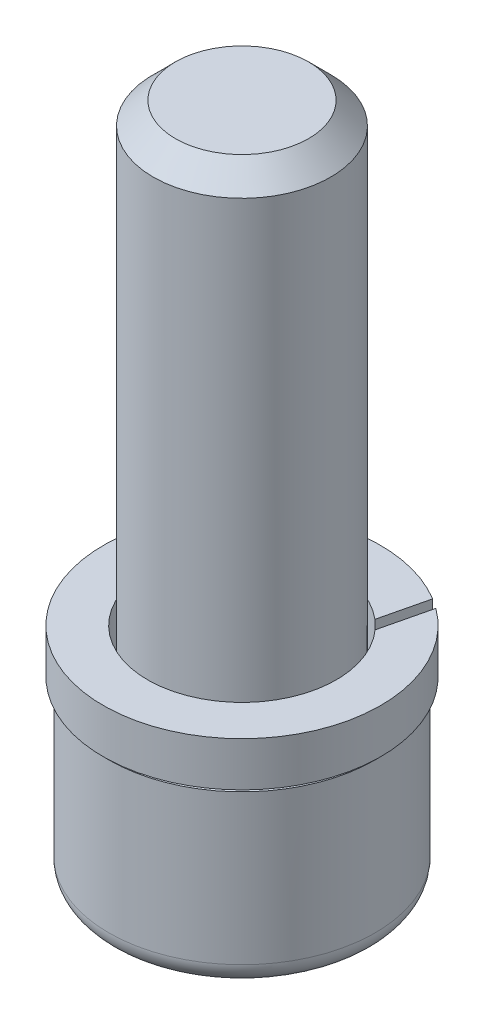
ISO-10303-21;
HEADER;
FILE_DESCRIPTION(('STEP AP214'),'2;1');
FILE_NAME('part.step','',(''),(''),'','','');
FILE_SCHEMA(('AUTOMOTIVE_DESIGN { 1 0 10303 214 1 1 1 1 }'));
ENDSEC;
DATA;
#1=APPLICATION_CONTEXT('core data for automotive mechanical design processes');
#2=APPLICATION_PROTOCOL_DEFINITION('international standard','automotive_design',2000,#1);
#3=PRODUCT_CONTEXT('',#1,'mechanical');
#4=PRODUCT('Part','Part','',(#3));
#5=PRODUCT_RELATED_PRODUCT_CATEGORY('part','',(#4));
#6=PRODUCT_DEFINITION_FORMATION('','',#4);
#7=PRODUCT_DEFINITION_CONTEXT('part definition',#1,'design');
#8=PRODUCT_DEFINITION('design','',#6,#7);
#9=PRODUCT_DEFINITION_SHAPE('','',#8);
#10=(LENGTH_UNIT() NAMED_UNIT(*) SI_UNIT(.MILLI.,.METRE.));
#11=(NAMED_UNIT(*) PLANE_ANGLE_UNIT() SI_UNIT($,.RADIAN.));
#12=(NAMED_UNIT(*) SI_UNIT($,.STERADIAN.) SOLID_ANGLE_UNIT());
#13=UNCERTAINTY_MEASURE_WITH_UNIT(LENGTH_MEASURE(1.E-05),#10,'distance_accuracy_value','');
#14=(GEOMETRIC_REPRESENTATION_CONTEXT(3) GLOBAL_UNCERTAINTY_ASSIGNED_CONTEXT((#13)) GLOBAL_UNIT_ASSIGNED_CONTEXT((#10,
#11,#12)) REPRESENTATION_CONTEXT('',''));
#15=CARTESIAN_POINT('',(0.,0.,0.));
#16=DIRECTION('',(0.,0.,1.));
#17=DIRECTION('',(1.,0.,0.));
#18=AXIS2_PLACEMENT_3D('',#15,#16,#17);
#19=CARTESIAN_POINT('',(0.,10.,0.));
#20=DIRECTION('',(0.,-1.,0.));
#21=DIRECTION('',(0.,0.,-1.));
#22=AXIS2_PLACEMENT_3D('',#19,#20,#21);
#23=PLANE('',#22);
#24=DIRECTION('',(-0.866025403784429,0.,-0.500000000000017));
#25=VECTOR('',#24,1.);
#26=CARTESIAN_POINT('',(0.,10.,-6.928203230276));
#27=LINE('',#26,#25);
#28=CARTESIAN_POINT('',(0.,10.,-6.92820323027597));
#29=VERTEX_POINT('',#28);
#30=CARTESIAN_POINT('',(6.00000000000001,10.,-3.46410161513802));
#31=VERTEX_POINT('',#30);
#32=EDGE_CURVE('E107',#29,#31,#27,.F.);
#33=ORIENTED_EDGE('',*,*,#32,.T.);
#34=DIRECTION('',(0.,0.,-1.));
#35=VECTOR('',#34,1.);
#36=CARTESIAN_POINT('',(6.,10.,-3.464101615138));
#37=LINE('',#36,#35);
#38=CARTESIAN_POINT('',(6.,10.,3.464101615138));
#39=VERTEX_POINT('',#38);
#40=EDGE_CURVE('E101',#31,#39,#37,.F.);
#41=ORIENTED_EDGE('',*,*,#40,.T.);
#42=DIRECTION('',(0.866025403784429,0.,-0.500000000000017));
#43=VECTOR('',#42,1.);
#44=CARTESIAN_POINT('',(6.,10.,3.464101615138));
#45=LINE('',#44,#43);
#46=CARTESIAN_POINT('',(1.95996647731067E-13,10.,6.92820323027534));
#47=VERTEX_POINT('',#46);
#48=EDGE_CURVE('E104',#39,#47,#45,.F.);
#49=ORIENTED_EDGE('',*,*,#48,.T.);
#50=DIRECTION('',(0.866025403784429,0.,0.500000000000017));
#51=VECTOR('',#50,1.);
#52=CARTESIAN_POINT('',(0.,10.,6.928203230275));
#53=LINE('',#52,#51);
#54=CARTESIAN_POINT('',(-5.9999999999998,10.,3.46410161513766));
#55=VERTEX_POINT('',#54);
#56=EDGE_CURVE('E127',#47,#55,#53,.F.);
#57=ORIENTED_EDGE('',*,*,#56,.T.);
#58=DIRECTION('',(0.,0.,1.));
#59=VECTOR('',#58,1.);
#60=CARTESIAN_POINT('',(-6.,10.,3.464101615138));
#61=LINE('',#60,#59);
#62=CARTESIAN_POINT('',(-6.,10.,-3.464101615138));
#63=VERTEX_POINT('',#62);
#64=EDGE_CURVE('E234',#55,#63,#61,.F.);
#65=ORIENTED_EDGE('',*,*,#64,.T.);
#66=DIRECTION('',(-0.866025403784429,0.,0.500000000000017));
#67=VECTOR('',#66,1.);
#68=CARTESIAN_POINT('',(-6.,10.,-3.464101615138));
#69=LINE('',#68,#67);
#70=EDGE_CURVE('E229',#63,#29,#69,.F.);
#71=ORIENTED_EDGE('',*,*,#70,.T.);
#72=EDGE_LOOP('',(#33,#41,#49,#57,#65,#71));
#73=FACE_BOUND('',#72,.T.);
#74=ADVANCED_FACE('F17',(#73),#23,.T.);
#75=CARTESIAN_POINT('',(6.,0.,-3.464101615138));
#76=DIRECTION('',(1.,0.,0.));
#77=DIRECTION('',(0.,0.,-1.));
#78=AXIS2_PLACEMENT_3D('',#75,#76,#77);
#79=PLANE('',#78);
#80=ORIENTED_EDGE('',*,*,#40,.F.);
#81=DIRECTION('',(0.,1.,0.));
#82=VECTOR('',#81,1.);
#83=CARTESIAN_POINT('',(6.00000000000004,0.,-3.46410161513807));
#84=LINE('',#83,#82);
#85=CARTESIAN_POINT('',(6.00000000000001,0.,-3.46410161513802));
#86=VERTEX_POINT('',#85);
#87=EDGE_CURVE('E214',#31,#86,#84,.F.);
#88=ORIENTED_EDGE('',*,*,#87,.T.);
#89=DIRECTION('',(0.,0.,1.));
#90=VECTOR('',#89,1.);
#91=CARTESIAN_POINT('',(6.,0.,0.));
#92=LINE('',#91,#90);
#93=CARTESIAN_POINT('',(6.,0.,3.464101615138));
#94=VERTEX_POINT('',#93);
#95=EDGE_CURVE('E117',#86,#94,#92,.T.);
#96=ORIENTED_EDGE('',*,*,#95,.T.);
#97=DIRECTION('',(0.,1.,0.));
#98=VECTOR('',#97,1.);
#99=CARTESIAN_POINT('',(6.,0.,3.464101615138));
#100=LINE('',#99,#98);
#101=EDGE_CURVE('E111',#94,#39,#100,.T.);
#102=ORIENTED_EDGE('',*,*,#101,.T.);
#103=EDGE_LOOP('',(#80,#88,#96,#102));
#104=FACE_BOUND('',#103,.T.);
#105=ADVANCED_FACE('F115',(#104),#79,.F.);
#106=CARTESIAN_POINT('',(6.,0.,3.464101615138));
#107=DIRECTION('',(0.500000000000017,0.,0.866025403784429));
#108=DIRECTION('',(0.866025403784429,0.,-0.500000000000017));
#109=AXIS2_PLACEMENT_3D('',#106,#107,#108);
#110=PLANE('',#109);
#111=ORIENTED_EDGE('',*,*,#48,.F.);
#112=ORIENTED_EDGE('',*,*,#101,.F.);
#113=DIRECTION('',(-0.866025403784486,0.,0.499999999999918));
#114=VECTOR('',#113,1.);
#115=CARTESIAN_POINT('',(6.,0.,3.464101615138));
#116=LINE('',#115,#114);
#117=CARTESIAN_POINT('',(1.95996647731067E-13,0.,6.92820323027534));
#118=VERTEX_POINT('',#117);
#119=EDGE_CURVE('E211',#94,#118,#116,.T.);
#120=ORIENTED_EDGE('',*,*,#119,.T.);
#121=DIRECTION('',(0.,1.,0.));
#122=VECTOR('',#121,1.);
#123=CARTESIAN_POINT('',(0.,0.,6.928203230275));
#124=LINE('',#123,#122);
#125=EDGE_CURVE('E124',#118,#47,#124,.T.);
#126=ORIENTED_EDGE('',*,*,#125,.T.);
#127=EDGE_LOOP('',(#111,#112,#120,#126));
#128=FACE_BOUND('',#127,.T.);
#129=ADVANCED_FACE('F122',(#128),#110,.F.);
#130=CARTESIAN_POINT('',(0.,0.,6.928203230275));
#131=DIRECTION('',(-0.500000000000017,0.,0.866025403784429));
#132=DIRECTION('',(0.866025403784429,0.,0.500000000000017));
#133=AXIS2_PLACEMENT_3D('',#130,#131,#132);
#134=PLANE('',#133);
#135=ORIENTED_EDGE('',*,*,#56,.F.);
#136=ORIENTED_EDGE('',*,*,#125,.F.);
#137=DIRECTION('',(-0.866025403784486,0.,-0.499999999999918));
#138=VECTOR('',#137,1.);
#139=CARTESIAN_POINT('',(0.,0.,6.928203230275));
#140=LINE('',#139,#138);
#141=CARTESIAN_POINT('',(-5.9999999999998,0.,3.46410161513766));
#142=VERTEX_POINT('',#141);
#143=EDGE_CURVE('E208',#118,#142,#140,.T.);
#144=ORIENTED_EDGE('',*,*,#143,.T.);
#145=DIRECTION('',(0.,1.,0.));
#146=VECTOR('',#145,1.);
#147=CARTESIAN_POINT('',(-6.,0.,3.464101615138));
#148=LINE('',#147,#146);
#149=EDGE_CURVE('E236',#142,#55,#148,.T.);
#150=ORIENTED_EDGE('',*,*,#149,.T.);
#151=EDGE_LOOP('',(#135,#136,#144,#150));
#152=FACE_BOUND('',#151,.T.);
#153=ADVANCED_FACE('F241',(#152),#134,.F.);
#154=CARTESIAN_POINT('',(-6.,0.,3.464101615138));
#155=DIRECTION('',(-1.,0.,0.));
#156=DIRECTION('',(0.,0.,1.));
#157=AXIS2_PLACEMENT_3D('',#154,#155,#156);
#158=PLANE('',#157);
#159=ORIENTED_EDGE('',*,*,#64,.F.);
#160=ORIENTED_EDGE('',*,*,#149,.F.);
#161=DIRECTION('',(0.,0.,1.));
#162=VECTOR('',#161,1.);
#163=CARTESIAN_POINT('',(-6.,0.,0.));
#164=LINE('',#163,#162);
#165=CARTESIAN_POINT('',(-6.,0.,-3.464101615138));
#166=VERTEX_POINT('',#165);
#167=EDGE_CURVE('E205',#142,#166,#164,.F.);
#168=ORIENTED_EDGE('',*,*,#167,.T.);
#169=DIRECTION('',(0.,1.,0.));
#170=VECTOR('',#169,1.);
#171=CARTESIAN_POINT('',(-6.,0.,-3.464101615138));
#172=LINE('',#171,#170);
#173=EDGE_CURVE('E231',#166,#63,#172,.T.);
#174=ORIENTED_EDGE('',*,*,#173,.T.);
#175=EDGE_LOOP('',(#159,#160,#168,#174));
#176=FACE_BOUND('',#175,.T.);
#177=ADVANCED_FACE('F246',(#176),#158,.F.);
#178=CARTESIAN_POINT('',(-6.,0.,-3.464101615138));
#179=DIRECTION('',(-0.500000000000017,0.,-0.866025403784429));
#180=DIRECTION('',(-0.866025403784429,0.,0.500000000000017));
#181=AXIS2_PLACEMENT_3D('',#178,#179,#180);
#182=PLANE('',#181);
#183=ORIENTED_EDGE('',*,*,#70,.F.);
#184=ORIENTED_EDGE('',*,*,#173,.F.);
#185=DIRECTION('',(0.866025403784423,0.,-0.500000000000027));
#186=VECTOR('',#185,1.);
#187=CARTESIAN_POINT('',(-6.,0.,-3.464101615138));
#188=LINE('',#187,#186);
#189=CARTESIAN_POINT('',(0.,0.,-6.92820323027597));
#190=VERTEX_POINT('',#189);
#191=EDGE_CURVE('E202',#166,#190,#188,.T.);
#192=ORIENTED_EDGE('',*,*,#191,.T.);
#193=DIRECTION('',(0.,1.,0.));
#194=VECTOR('',#193,1.);
#195=CARTESIAN_POINT('',(0.,0.,-6.928203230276));
#196=LINE('',#195,#194);
#197=EDGE_CURVE('E226',#190,#29,#196,.T.);
#198=ORIENTED_EDGE('',*,*,#197,.T.);
#199=EDGE_LOOP('',(#183,#184,#192,#198));
#200=FACE_BOUND('',#199,.T.);
#201=ADVANCED_FACE('F252',(#200),#182,.F.);
#202=CARTESIAN_POINT('',(0.,0.,-6.928203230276));
#203=DIRECTION('',(0.500000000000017,0.,-0.866025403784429));
#204=DIRECTION('',(-0.866025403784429,0.,-0.500000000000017));
#205=AXIS2_PLACEMENT_3D('',#202,#203,#204);
#206=PLANE('',#205);
#207=ORIENTED_EDGE('',*,*,#32,.F.);
#208=ORIENTED_EDGE('',*,*,#197,.F.);
#209=DIRECTION('',(0.866025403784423,0.,0.500000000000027));
#210=VECTOR('',#209,1.);
#211=CARTESIAN_POINT('',(0.,0.,-6.928203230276));
#212=LINE('',#211,#210);
#213=EDGE_CURVE('E194',#190,#86,#212,.T.);
#214=ORIENTED_EDGE('',*,*,#213,.T.);
#215=ORIENTED_EDGE('',*,*,#87,.F.);
#216=EDGE_LOOP('',(#207,#208,#214,#215));
#217=FACE_BOUND('',#216,.T.);
#218=ADVANCED_FACE('F185',(#217),#206,.F.);
#219=CARTESIAN_POINT('',(0.,0.,0.));
#220=DIRECTION('',(0.,1.,0.));
#221=DIRECTION('',(0.,0.,1.));
#222=AXIS2_PLACEMENT_3D('',#219,#220,#221);
#223=PLANE('',#222);
#224=ORIENTED_EDGE('',*,*,#191,.F.);
#225=ORIENTED_EDGE('',*,*,#167,.F.);
#226=ORIENTED_EDGE('',*,*,#143,.F.);
#227=ORIENTED_EDGE('',*,*,#119,.F.);
#228=ORIENTED_EDGE('',*,*,#95,.F.);
#229=ORIENTED_EDGE('',*,*,#213,.F.);
#230=EDGE_LOOP('',(#224,#225,#226,#227,#228,#229));
#231=FACE_BOUND('',#230,.T.);
#232=CARTESIAN_POINT('',(0.,0.,0.));
#233=DIRECTION('',(0.,1.,0.));
#234=DIRECTION('',(-1.,0.,0.));
#235=AXIS2_PLACEMENT_3D('',#232,#233,#234);
#236=CIRCLE('',#235,10.);
#237=CARTESIAN_POINT('',(-10.,0.,0.));
#238=VERTEX_POINT('',#237);
#239=CARTESIAN_POINT('',(10.,0.,0.));
#240=VERTEX_POINT('',#239);
#241=EDGE_CURVE('E74',#238,#240,#236,.T.);
#242=ORIENTED_EDGE('',*,*,#241,.F.);
#243=CARTESIAN_POINT('',(0.,0.,0.));
#244=DIRECTION('',(0.,1.,0.));
#245=DIRECTION('',(1.,0.,0.));
#246=AXIS2_PLACEMENT_3D('',#243,#244,#245);
#247=CIRCLE('',#246,10.);
#248=EDGE_CURVE('E160',#240,#238,#247,.T.);
#249=ORIENTED_EDGE('',*,*,#248,.F.);
#250=EDGE_LOOP('',(#242,#249));
#251=FACE_BOUND('',#250,.T.);
#252=ADVANCED_FACE('F175',(#231,#251),#223,.F.);
#253=CARTESIAN_POINT('',(0.,2.,0.));
#254=DIRECTION('',(0.,1.,0.));
#255=DIRECTION('',(-0.999917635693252,0.,0.0128344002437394));
#256=AXIS2_PLACEMENT_3D('',#253,#254,#255);
#257=TOROIDAL_SURFACE('',#256,10.,2.);
#258=CARTESIAN_POINT('',(0.,2.,0.));
#259=DIRECTION('',(0.,1.,0.));
#260=DIRECTION('',(0.,0.,1.));
#261=AXIS2_PLACEMENT_3D('',#258,#259,#260);
#262=CIRCLE('',#261,12.);
#263=CARTESIAN_POINT('',(0.,2.,12.));
#264=VERTEX_POINT('',#263);
#265=EDGE_CURVE('E157',#264,#264,#262,.T.);
#266=ORIENTED_EDGE('',*,*,#265,.F.);
#267=EDGE_LOOP('',(#266));
#268=FACE_BOUND('',#267,.T.);
#269=ORIENTED_EDGE('',*,*,#248,.T.);
#270=ORIENTED_EDGE('',*,*,#241,.T.);
#271=EDGE_LOOP('',(#269,#270));
#272=FACE_BOUND('',#271,.T.);
#273=ADVANCED_FACE('F184',(#268,#272),#257,.T.);
#274=CARTESIAN_POINT('',(0.,0.,0.));
#275=DIRECTION('',(0.,1.,0.));
#276=DIRECTION('',(0.,0.,1.));
#277=AXIS2_PLACEMENT_3D('',#274,#275,#276);
#278=CYLINDRICAL_SURFACE('',#277,12.);
#279=CARTESIAN_POINT('',(0.,15.5000051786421,0.));
#280=DIRECTION('',(0.,-1.,0.));
#281=DIRECTION('',(1.,0.,0.));
#282=AXIS2_PLACEMENT_3D('',#279,#280,#281);
#283=CIRCLE('',#282,12.);
#284=CARTESIAN_POINT('',(12.,15.5000051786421,0.));
#285=VERTEX_POINT('',#284);
#286=EDGE_CURVE('E153',#285,#285,#283,.F.);
#287=ORIENTED_EDGE('',*,*,#286,.F.);
#288=EDGE_LOOP('',(#287));
#289=FACE_BOUND('',#288,.T.);
#290=ORIENTED_EDGE('',*,*,#265,.T.);
#291=EDGE_LOOP('',(#290));
#292=FACE_BOUND('',#291,.T.);
#293=ADVANCED_FACE('F311',(#289,#292),#278,.T.);
#294=CARTESIAN_POINT('',(0.,15.5000007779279,0.));
#295=DIRECTION('',(0.,-1.,0.));
#296=DIRECTION('',(1.,0.,0.));
#297=AXIS2_PLACEMENT_3D('',#294,#295,#296);
#298=CONICAL_SURFACE('',#297,12.0000044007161,0.785398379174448);
#299=ORIENTED_EDGE('',*,*,#286,.T.);
#300=EDGE_LOOP('',(#299));
#301=FACE_BOUND('',#300,.T.);
#302=CARTESIAN_POINT('',(0.,15.999999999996,0.));
#303=DIRECTION('',(0.,-1.,0.));
#304=DIRECTION('',(1.,0.,0.));
#305=AXIS2_PLACEMENT_3D('',#302,#303,#304);
#306=CIRCLE('',#305,11.5000049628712);
#307=CARTESIAN_POINT('',(6.26897972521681,15.9999999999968,-9.64105841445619));
#308=VERTEX_POINT('',#307);
#309=CARTESIAN_POINT('',(7.14612872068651,15.9999999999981,-9.01015862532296));
#310=VERTEX_POINT('',#309);
#311=EDGE_CURVE('E65',#308,#310,#306,.T.);
#312=ORIENTED_EDGE('',*,*,#311,.T.);
#313=CARTESIAN_POINT('',(0.,15.9999999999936,0.));
#314=DIRECTION('',(0.,-1.,0.));
#315=DIRECTION('',(1.,0.,0.));
#316=AXIS2_PLACEMENT_3D('',#313,#314,#315);
#317=CIRCLE('',#316,11.5000049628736);
#318=EDGE_CURVE('E149',#310,#308,#317,.T.);
#319=ORIENTED_EDGE('',*,*,#318,.T.);
#320=EDGE_LOOP('',(#312,#319));
#321=FACE_BOUND('',#320,.T.);
#322=ADVANCED_FACE('F308',(#301,#321),#298,.T.);
#323=CARTESIAN_POINT('',(0.,16.,0.));
#324=DIRECTION('',(0.,1.,0.));
#325=DIRECTION('',(0.,0.,1.));
#326=AXIS2_PLACEMENT_3D('',#323,#324,#325);
#327=PLANE('',#326);
#328=ORIENTED_EDGE('',*,*,#318,.F.);
#329=DIRECTION('',(-0.232984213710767,0.,0.972480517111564));
#330=VECTOR('',#329,1.);
#331=CARTESIAN_POINT('',(7.400896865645,16.,-10.07356568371));
#332=LINE('',#331,#330);
#333=CARTESIAN_POINT('',(7.40089686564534,16.,-10.0735656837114));
#334=VERTEX_POINT('',#333);
#335=EDGE_CURVE('E152',#334,#310,#332,.T.);
#336=ORIENTED_EDGE('',*,*,#335,.F.);
#337=CARTESIAN_POINT('',(0.,16.,0.));
#338=DIRECTION('',(0.,1.,0.));
#339=DIRECTION('',(0.,0.,1.));
#340=AXIS2_PLACEMENT_3D('',#337,#338,#339);
#341=CIRCLE('',#340,12.5);
#342=CARTESIAN_POINT('',(6.51499590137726,16.,-10.6679345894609));
#343=VERTEX_POINT('',#342);
#344=EDGE_CURVE('E146',#343,#334,#341,.T.);
#345=ORIENTED_EDGE('',*,*,#344,.F.);
#346=DIRECTION('',(0.232984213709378,0.,-0.972480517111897));
#347=VECTOR('',#346,1.);
#348=CARTESIAN_POINT('',(6.268979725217,16.,-9.641058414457));
#349=LINE('',#348,#347);
#350=EDGE_CURVE('E156',#308,#343,#349,.T.);
#351=ORIENTED_EDGE('',*,*,#350,.F.);
#352=EDGE_LOOP('',(#328,#336,#345,#351));
#353=FACE_BOUND('',#352,.T.);
#354=ADVANCED_FACE('F304',(#353),#327,.F.);
#355=CARTESIAN_POINT('',(0.,16.,0.));
#356=DIRECTION('',(0.,1.,0.));
#357=DIRECTION('',(0.,0.,1.));
#358=AXIS2_PLACEMENT_3D('',#355,#356,#357);
#359=CYLINDRICAL_SURFACE('',#358,12.5);
#360=DIRECTION('',(0.,1.,0.));
#361=VECTOR('',#360,1.);
#362=CARTESIAN_POINT('',(6.5149959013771,16.,-10.66793458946));
#363=LINE('',#362,#361);
#364=CARTESIAN_POINT('',(6.51499590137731,20.,-10.6679345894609));
#365=VERTEX_POINT('',#364);
#366=EDGE_CURVE('E429',#343,#365,#363,.T.);
#367=ORIENTED_EDGE('',*,*,#366,.F.);
#368=ORIENTED_EDGE('',*,*,#344,.T.);
#369=DIRECTION('',(0.,1.,0.));
#370=VECTOR('',#369,1.);
#371=CARTESIAN_POINT('',(7.400896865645,16.,-10.07356568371));
#372=LINE('',#371,#370);
#373=CARTESIAN_POINT('',(7.40089686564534,20.,-10.0735656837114));
#374=VERTEX_POINT('',#373);
#375=EDGE_CURVE('E417',#374,#334,#372,.F.);
#376=ORIENTED_EDGE('',*,*,#375,.F.);
#377=CARTESIAN_POINT('',(0.,20.,0.));
#378=DIRECTION('',(0.,1.,0.));
#379=DIRECTION('',(0.,0.,1.));
#380=AXIS2_PLACEMENT_3D('',#377,#378,#379);
#381=CIRCLE('',#380,12.5);
#382=EDGE_CURVE('E144',#365,#374,#381,.T.);
#383=ORIENTED_EDGE('',*,*,#382,.F.);
#384=EDGE_LOOP('',(#367,#368,#376,#383));
#385=FACE_BOUND('',#384,.T.);
#386=ADVANCED_FACE('F300',(#385),#359,.T.);
#387=CARTESIAN_POINT('',(0.,20.,0.));
#388=DIRECTION('',(0.,1.,0.));
#389=DIRECTION('',(0.,0.,1.));
#390=AXIS2_PLACEMENT_3D('',#387,#388,#389);
#391=PLANE('',#390);
#392=CARTESIAN_POINT('',(0.,20.,0.));
#393=DIRECTION('',(0.,1.,0.));
#394=DIRECTION('',(0.,0.,1.));
#395=AXIS2_PLACEMENT_3D('',#392,#393,#394);
#396=CIRCLE('',#395,8.5);
#397=CARTESIAN_POINT('',(6.34307840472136,20.,-5.65821140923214));
#398=VERTEX_POINT('',#397);
#399=CARTESIAN_POINT('',(5.50983643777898,20.,-6.47237996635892));
#400=VERTEX_POINT('',#399);
#401=EDGE_CURVE('E142',#398,#400,#396,.F.);
#402=ORIENTED_EDGE('',*,*,#401,.T.);
#403=DIRECTION('',(0.232984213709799,0.,-0.972480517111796));
#404=VECTOR('',#403,1.);
#405=CARTESIAN_POINT('',(5.509836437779,20.,-6.472379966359));
#406=LINE('',#405,#404);
#407=EDGE_CURVE('E424',#365,#400,#406,.F.);
#408=ORIENTED_EDGE('',*,*,#407,.F.);
#409=ORIENTED_EDGE('',*,*,#382,.T.);
#410=DIRECTION('',(-0.232984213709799,0.,0.972480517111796));
#411=VECTOR('',#410,1.);
#412=CARTESIAN_POINT('',(7.400896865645,20.,-10.07356568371));
#413=LINE('',#412,#411);
#414=EDGE_CURVE('E426',#398,#374,#413,.F.);
#415=ORIENTED_EDGE('',*,*,#414,.F.);
#416=EDGE_LOOP('',(#402,#408,#409,#415));
#417=FACE_BOUND('',#416,.T.);
#418=ADVANCED_FACE('F297',(#417),#391,.T.);
#419=CARTESIAN_POINT('',(0.,16.,0.));
#420=DIRECTION('',(0.,1.,0.));
#421=DIRECTION('',(0.,0.,1.));
#422=AXIS2_PLACEMENT_3D('',#419,#420,#421);
#423=CYLINDRICAL_SURFACE('',#422,8.5);
#424=ORIENTED_EDGE('',*,*,#401,.F.);
#425=DIRECTION('',(0.,1.,0.));
#426=VECTOR('',#425,1.);
#427=CARTESIAN_POINT('',(6.34307840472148,16.,-5.65821140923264));
#428=LINE('',#427,#426);
#429=CARTESIAN_POINT('',(6.34307840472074,16.,-5.65821140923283));
#430=VERTEX_POINT('',#429);
#431=EDGE_CURVE('E37',#430,#398,#428,.T.);
#432=ORIENTED_EDGE('',*,*,#431,.F.);
#433=CARTESIAN_POINT('',(0.,16.,0.));
#434=DIRECTION('',(0.,1.,0.));
#435=DIRECTION('',(0.,0.,1.));
#436=AXIS2_PLACEMENT_3D('',#433,#434,#435);
#437=CIRCLE('',#436,8.5);
#438=CARTESIAN_POINT('',(5.50983643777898,16.,-6.47237996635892));
#439=VERTEX_POINT('',#438);
#440=EDGE_CURVE('E137',#439,#430,#437,.T.);
#441=ORIENTED_EDGE('',*,*,#440,.F.);
#442=DIRECTION('',(0.,1.,0.));
#443=VECTOR('',#442,1.);
#444=CARTESIAN_POINT('',(5.509836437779,16.,-6.472379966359));
#445=LINE('',#444,#443);
#446=EDGE_CURVE('E141',#400,#439,#445,.F.);
#447=ORIENTED_EDGE('',*,*,#446,.F.);
#448=EDGE_LOOP('',(#424,#432,#441,#447));
#449=FACE_BOUND('',#448,.T.);
#450=ADVANCED_FACE('F293',(#449),#423,.F.);
#451=CARTESIAN_POINT('',(7.400896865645,16.,-10.07356568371));
#452=DIRECTION('',(-0.972480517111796,0.,-0.232984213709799));
#453=DIRECTION('',(-0.232984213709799,0.,0.972480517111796));
#454=AXIS2_PLACEMENT_3D('',#451,#452,#453);
#455=PLANE('',#454);
#456=ORIENTED_EDGE('',*,*,#335,.T.);
#457=DIRECTION('',(0.232984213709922,0.,-0.972480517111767));
#458=VECTOR('',#457,1.);
#459=CARTESIAN_POINT('',(6.34307840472,16.,-5.658211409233));
#460=LINE('',#459,#458);
#461=EDGE_CURVE('E140',#430,#310,#460,.T.);
#462=ORIENTED_EDGE('',*,*,#461,.F.);
#463=ORIENTED_EDGE('',*,*,#431,.T.);
#464=ORIENTED_EDGE('',*,*,#414,.T.);
#465=ORIENTED_EDGE('',*,*,#375,.T.);
#466=EDGE_LOOP('',(#456,#462,#463,#464,#465));
#467=FACE_BOUND('',#466,.T.);
#468=ADVANCED_FACE('F289',(#467),#455,.T.);
#469=CARTESIAN_POINT('',(5.509836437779,16.,-6.472379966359));
#470=DIRECTION('',(0.972480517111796,0.,0.232984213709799));
#471=DIRECTION('',(0.232984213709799,0.,-0.972480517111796));
#472=AXIS2_PLACEMENT_3D('',#469,#470,#471);
#473=PLANE('',#472);
#474=ORIENTED_EDGE('',*,*,#446,.T.);
#475=DIRECTION('',(-0.232984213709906,0.,0.972480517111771));
#476=VECTOR('',#475,1.);
#477=CARTESIAN_POINT('',(6.268979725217,16.,-9.641058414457));
#478=LINE('',#477,#476);
#479=EDGE_CURVE('E136',#308,#439,#478,.T.);
#480=ORIENTED_EDGE('',*,*,#479,.F.);
#481=ORIENTED_EDGE('',*,*,#350,.T.);
#482=ORIENTED_EDGE('',*,*,#366,.T.);
#483=ORIENTED_EDGE('',*,*,#407,.T.);
#484=EDGE_LOOP('',(#474,#480,#481,#482,#483));
#485=FACE_BOUND('',#484,.T.);
#486=ADVANCED_FACE('F285',(#485),#473,.T.);
#487=CARTESIAN_POINT('',(0.,61.,0.));
#488=DIRECTION('',(0.,1.,0.));
#489=DIRECTION('',(0.,0.,1.));
#490=AXIS2_PLACEMENT_3D('',#487,#488,#489);
#491=PLANE('',#490);
#492=CARTESIAN_POINT('',(0.,61.,0.));
#493=DIRECTION('',(0.,1.,0.));
#494=DIRECTION('',(0.,0.,1.));
#495=AXIS2_PLACEMENT_3D('',#492,#493,#494);
#496=CIRCLE('',#495,5.9999891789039);
#497=CARTESIAN_POINT('',(0.,61.,5.9999891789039));
#498=VERTEX_POINT('',#497);
#499=EDGE_CURVE('E133',#498,#498,#496,.F.);
#500=ORIENTED_EDGE('',*,*,#499,.F.);
#501=EDGE_LOOP('',(#500));
#502=FACE_BOUND('',#501,.T.);
#503=ADVANCED_FACE('F281',(#502),#491,.T.);
#504=CARTESIAN_POINT('',(0.,16.,0.));
#505=DIRECTION('',(0.,1.,0.));
#506=DIRECTION('',(0.,0.,1.));
#507=AXIS2_PLACEMENT_3D('',#504,#505,#506);
#508=PLANE('',#507);
#509=CARTESIAN_POINT('',(0.,16.,0.));
#510=DIRECTION('',(0.,1.,0.));
#511=DIRECTION('',(0.,0.,1.));
#512=AXIS2_PLACEMENT_3D('',#509,#510,#511);
#513=CIRCLE('',#512,8.);
#514=CARTESIAN_POINT('',(0.,16.,8.));
#515=VERTEX_POINT('',#514);
#516=EDGE_CURVE('E28',#515,#515,#513,.T.);
#517=ORIENTED_EDGE('',*,*,#516,.F.);
#518=EDGE_LOOP('',(#517));
#519=FACE_BOUND('',#518,.T.);
#520=ORIENTED_EDGE('',*,*,#311,.F.);
#521=ORIENTED_EDGE('',*,*,#479,.T.);
#522=ORIENTED_EDGE('',*,*,#440,.T.);
#523=ORIENTED_EDGE('',*,*,#461,.T.);
#524=EDGE_LOOP('',(#520,#521,#522,#523));
#525=FACE_BOUND('',#524,.T.);
#526=ADVANCED_FACE('F274',(#519,#525),#508,.T.);
#527=CARTESIAN_POINT('',(0.,58.9999912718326,0.));
#528=DIRECTION('',(0.,-1.,0.));
#529=DIRECTION('',(0.,0.,-1.));
#530=AXIS2_PLACEMENT_3D('',#527,#528,#529);
#531=CONICAL_SURFACE('',#530,7.99999430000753,0.785397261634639);
#532=CARTESIAN_POINT('',(0.,58.9999855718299,0.));
#533=DIRECTION('',(0.,-1.,0.));
#534=DIRECTION('',(0.,0.,-1.));
#535=AXIS2_PLACEMENT_3D('',#532,#533,#534);
#536=CIRCLE('',#535,8.);
#537=CARTESIAN_POINT('',(0.,58.9999855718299,-8.));
#538=VERTEX_POINT('',#537);
#539=EDGE_CURVE('E11',#538,#538,#536,.T.);
#540=ORIENTED_EDGE('',*,*,#539,.F.);
#541=EDGE_LOOP('',(#540));
#542=FACE_BOUND('',#541,.T.);
#543=ORIENTED_EDGE('',*,*,#499,.T.);
#544=EDGE_LOOP('',(#543));
#545=FACE_BOUND('',#544,.T.);
#546=ADVANCED_FACE('F268',(#542,#545),#531,.T.);
#547=CARTESIAN_POINT('',(0.,16.,0.));
#548=DIRECTION('',(0.,1.,0.));
#549=DIRECTION('',(0.,0.,1.));
#550=AXIS2_PLACEMENT_3D('',#547,#548,#549);
#551=CYLINDRICAL_SURFACE('',#550,8.);
#552=ORIENTED_EDGE('',*,*,#516,.T.);
#553=EDGE_LOOP('',(#552));
#554=FACE_BOUND('',#553,.T.);
#555=ORIENTED_EDGE('',*,*,#539,.T.);
#556=EDGE_LOOP('',(#555));
#557=FACE_BOUND('',#556,.T.);
#558=ADVANCED_FACE('F266',(#554,#557),#551,.T.);
#559=CLOSED_SHELL('',(#74,#105,#129,#153,#177,#201,#218,#252,#273,#293,#322,#354,#386,#418,#450,
#468,#486,#503,#526,#546,#558));
#560=MANIFOLD_SOLID_BREP('B1',#559);
#561=ADVANCED_BREP_SHAPE_REPRESENTATION('',(#18,#560),#14);
#562=SHAPE_DEFINITION_REPRESENTATION(#9,#561);
ENDSEC;
END-ISO-10303-21;
